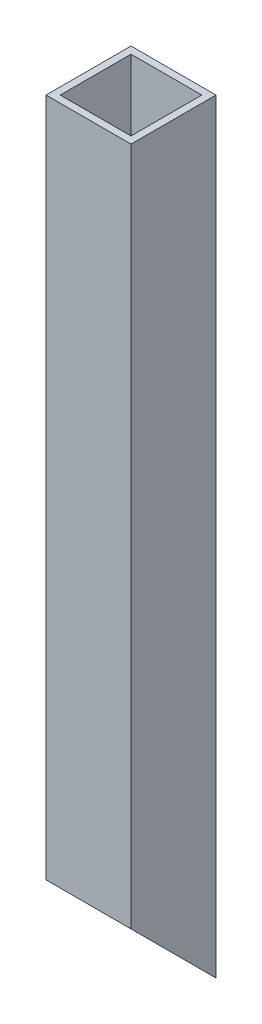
ISO-10303-21;
HEADER;
FILE_DESCRIPTION(('STEP AP214'),'2;1');
FILE_NAME('part.step','',(''),(''),'','','');
FILE_SCHEMA(('AUTOMOTIVE_DESIGN { 1 0 10303 214 1 1 1 1 }'));
ENDSEC;
DATA;
#1=APPLICATION_CONTEXT('core data for automotive mechanical design processes');
#2=APPLICATION_PROTOCOL_DEFINITION('international standard','automotive_design',2000,#1);
#3=PRODUCT_CONTEXT('',#1,'mechanical');
#4=PRODUCT('Part','Part','',(#3));
#5=PRODUCT_RELATED_PRODUCT_CATEGORY('part','',(#4));
#6=PRODUCT_DEFINITION_FORMATION('','',#4);
#7=PRODUCT_DEFINITION_CONTEXT('part definition',#1,'design');
#8=PRODUCT_DEFINITION('design','',#6,#7);
#9=PRODUCT_DEFINITION_SHAPE('','',#8);
#10=(LENGTH_UNIT() NAMED_UNIT(*) SI_UNIT(.MILLI.,.METRE.));
#11=(NAMED_UNIT(*) PLANE_ANGLE_UNIT() SI_UNIT($,.RADIAN.));
#12=(NAMED_UNIT(*) SI_UNIT($,.STERADIAN.) SOLID_ANGLE_UNIT());
#13=UNCERTAINTY_MEASURE_WITH_UNIT(LENGTH_MEASURE(1.E-05),#10,'distance_accuracy_value','');
#14=(GEOMETRIC_REPRESENTATION_CONTEXT(3) GLOBAL_UNCERTAINTY_ASSIGNED_CONTEXT((#13)) GLOBAL_UNIT_ASSIGNED_CONTEXT((#10,
#11,#12)) REPRESENTATION_CONTEXT('',''));
#15=CARTESIAN_POINT('',(0.,0.,0.));
#16=DIRECTION('',(0.,0.,1.));
#17=DIRECTION('',(1.,0.,0.));
#18=AXIS2_PLACEMENT_3D('',#15,#16,#17);
#19=CARTESIAN_POINT('',(-19.05,304.8,-19.05));
#20=DIRECTION('',(0.,0.,-1.));
#21=DIRECTION('',(-1.,0.,0.));
#22=AXIS2_PLACEMENT_3D('',#19,#20,#21);
#23=PLANE('',#22);
#24=DIRECTION('',(0.,-1.,0.));
#25=VECTOR('',#24,1.);
#26=CARTESIAN_POINT('',(19.05,304.8,-19.05));
#27=LINE('',#26,#25);
#28=CARTESIAN_POINT('',(19.05,304.8,-19.05));
#29=VERTEX_POINT('',#28);
#30=CARTESIAN_POINT('',(19.05,-38.1000000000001,-19.05));
#31=VERTEX_POINT('',#30);
#32=EDGE_CURVE('E150',#29,#31,#27,.T.);
#33=ORIENTED_EDGE('',*,*,#32,.T.);
#34=DIRECTION('',(1.,0.,0.));
#35=VECTOR('',#34,1.);
#36=CARTESIAN_POINT('',(-72.931536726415,-38.1000000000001,-19.05));
#37=LINE('',#36,#35);
#38=CARTESIAN_POINT('',(-19.05,-38.1000000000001,-19.05));
#39=VERTEX_POINT('',#38);
#40=EDGE_CURVE('E186',#39,#31,#37,.T.);
#41=ORIENTED_EDGE('',*,*,#40,.F.);
#42=DIRECTION('',(0.,-1.,0.));
#43=VECTOR('',#42,1.);
#44=CARTESIAN_POINT('',(-19.05,304.8,-19.05));
#45=LINE('',#44,#43);
#46=CARTESIAN_POINT('',(-19.05,304.8,-19.05));
#47=VERTEX_POINT('',#46);
#48=EDGE_CURVE('E141',#47,#39,#45,.T.);
#49=ORIENTED_EDGE('',*,*,#48,.F.);
#50=DIRECTION('',(1.,0.,0.));
#51=VECTOR('',#50,1.);
#52=CARTESIAN_POINT('',(-19.05,304.8,-19.05));
#53=LINE('',#52,#51);
#54=EDGE_CURVE('E163',#47,#29,#53,.T.);
#55=ORIENTED_EDGE('',*,*,#54,.T.);
#56=EDGE_LOOP('',(#33,#41,#49,#55));
#57=FACE_BOUND('',#56,.T.);
#58=ADVANCED_FACE('F64',(#57),#23,.T.);
#59=CARTESIAN_POINT('',(-19.05,304.8,-19.05));
#60=DIRECTION('',(1.,0.,0.));
#61=DIRECTION('',(0.,0.,-1.));
#62=AXIS2_PLACEMENT_3D('',#59,#60,#61);
#63=PLANE('',#62);
#64=ORIENTED_EDGE('',*,*,#48,.T.);
#65=DIRECTION('',(0.,0.707106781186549,0.707106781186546));
#66=VECTOR('',#65,1.);
#67=CARTESIAN_POINT('',(-19.05,-38.1000000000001,-19.05));
#68=LINE('',#67,#66);
#69=CARTESIAN_POINT('',(-19.05,0.,19.05));
#70=VERTEX_POINT('',#69);
#71=EDGE_CURVE('E183',#39,#70,#68,.T.);
#72=ORIENTED_EDGE('',*,*,#71,.T.);
#73=DIRECTION('',(0.,-1.,0.));
#74=VECTOR('',#73,1.);
#75=CARTESIAN_POINT('',(-19.05,304.8,19.05));
#76=LINE('',#75,#74);
#77=CARTESIAN_POINT('',(-19.05,304.8,19.05));
#78=VERTEX_POINT('',#77);
#79=EDGE_CURVE('E156',#78,#70,#76,.T.);
#80=ORIENTED_EDGE('',*,*,#79,.F.);
#81=DIRECTION('',(0.,0.,1.));
#82=VECTOR('',#81,1.);
#83=CARTESIAN_POINT('',(-19.05,304.8,-19.05));
#84=LINE('',#83,#82);
#85=EDGE_CURVE('E153',#47,#78,#84,.T.);
#86=ORIENTED_EDGE('',*,*,#85,.F.);
#87=EDGE_LOOP('',(#64,#72,#80,#86));
#88=FACE_BOUND('',#87,.T.);
#89=ADVANCED_FACE('F209',(#88),#63,.F.);
#90=CARTESIAN_POINT('',(-19.05,304.8,19.05));
#91=DIRECTION('',(0.,0.,-1.));
#92=DIRECTION('',(-1.,0.,0.));
#93=AXIS2_PLACEMENT_3D('',#90,#91,#92);
#94=PLANE('',#93);
#95=DIRECTION('',(1.,0.,0.));
#96=VECTOR('',#95,1.);
#97=CARTESIAN_POINT('',(-19.05,0.,19.05));
#98=LINE('',#97,#96);
#99=CARTESIAN_POINT('',(19.05,0.,19.05));
#100=VERTEX_POINT('',#99);
#101=EDGE_CURVE('E160',#70,#100,#98,.T.);
#102=ORIENTED_EDGE('',*,*,#101,.T.);
#103=DIRECTION('',(0.,-1.,0.));
#104=VECTOR('',#103,1.);
#105=CARTESIAN_POINT('',(19.05,304.8,19.05));
#106=LINE('',#105,#104);
#107=CARTESIAN_POINT('',(19.05,304.8,19.05));
#108=VERTEX_POINT('',#107);
#109=EDGE_CURVE('E152',#108,#100,#106,.T.);
#110=ORIENTED_EDGE('',*,*,#109,.F.);
#111=DIRECTION('',(1.,0.,0.));
#112=VECTOR('',#111,1.);
#113=CARTESIAN_POINT('',(-19.05,304.8,19.05));
#114=LINE('',#113,#112);
#115=EDGE_CURVE('E166',#78,#108,#114,.T.);
#116=ORIENTED_EDGE('',*,*,#115,.F.);
#117=ORIENTED_EDGE('',*,*,#79,.T.);
#118=EDGE_LOOP('',(#102,#110,#116,#117));
#119=FACE_BOUND('',#118,.T.);
#120=ADVANCED_FACE('F206',(#119),#94,.F.);
#121=CARTESIAN_POINT('',(19.05,304.8,-19.05));
#122=DIRECTION('',(1.,0.,0.));
#123=DIRECTION('',(0.,0.,-1.));
#124=AXIS2_PLACEMENT_3D('',#121,#122,#123);
#125=PLANE('',#124);
#126=ORIENTED_EDGE('',*,*,#109,.T.);
#127=DIRECTION('',(0.,-0.707106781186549,-0.707106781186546));
#128=VECTOR('',#127,1.);
#129=CARTESIAN_POINT('',(19.05,-38.1000000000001,-19.05));
#130=LINE('',#129,#128);
#131=EDGE_CURVE('E189',#100,#31,#130,.T.);
#132=ORIENTED_EDGE('',*,*,#131,.T.);
#133=ORIENTED_EDGE('',*,*,#32,.F.);
#134=DIRECTION('',(0.,0.,1.));
#135=VECTOR('',#134,1.);
#136=CARTESIAN_POINT('',(19.05,304.8,-19.05));
#137=LINE('',#136,#135);
#138=EDGE_CURVE('E168',#29,#108,#137,.T.);
#139=ORIENTED_EDGE('',*,*,#138,.T.);
#140=EDGE_LOOP('',(#126,#132,#133,#139));
#141=FACE_BOUND('',#140,.T.);
#142=ADVANCED_FACE('F192',(#141),#125,.T.);
#143=CARTESIAN_POINT('',(0.,304.8,0.));
#144=DIRECTION('',(0.,-1.,0.));
#145=DIRECTION('',(0.,0.,-1.));
#146=AXIS2_PLACEMENT_3D('',#143,#144,#145);
#147=PLANE('',#146);
#148=DIRECTION('',(0.,0.,1.));
#149=VECTOR('',#148,1.);
#150=CARTESIAN_POINT('',(-15.875,304.8,-15.875));
#151=LINE('',#150,#149);
#152=CARTESIAN_POINT('',(-15.875,304.8,-15.875));
#153=VERTEX_POINT('',#152);
#154=CARTESIAN_POINT('',(-15.875,304.8,15.875));
#155=VERTEX_POINT('',#154);
#156=EDGE_CURVE('E133',#153,#155,#151,.T.);
#157=ORIENTED_EDGE('',*,*,#156,.F.);
#158=DIRECTION('',(1.,0.,0.));
#159=VECTOR('',#158,1.);
#160=CARTESIAN_POINT('',(-15.875,304.8,-15.875));
#161=LINE('',#160,#159);
#162=CARTESIAN_POINT('',(15.875,304.8,-15.875));
#163=VERTEX_POINT('',#162);
#164=EDGE_CURVE('E181',#153,#163,#161,.T.);
#165=ORIENTED_EDGE('',*,*,#164,.T.);
#166=DIRECTION('',(0.,0.,1.));
#167=VECTOR('',#166,1.);
#168=CARTESIAN_POINT('',(15.875,304.8,-15.875));
#169=LINE('',#168,#167);
#170=CARTESIAN_POINT('',(15.875,304.8,15.875));
#171=VERTEX_POINT('',#170);
#172=EDGE_CURVE('E131',#163,#171,#169,.T.);
#173=ORIENTED_EDGE('',*,*,#172,.T.);
#174=DIRECTION('',(1.,0.,0.));
#175=VECTOR('',#174,1.);
#176=CARTESIAN_POINT('',(-15.875,304.8,15.875));
#177=LINE('',#176,#175);
#178=EDGE_CURVE('E178',#155,#171,#177,.T.);
#179=ORIENTED_EDGE('',*,*,#178,.F.);
#180=EDGE_LOOP('',(#157,#165,#173,#179));
#181=FACE_BOUND('',#180,.T.);
#182=ORIENTED_EDGE('',*,*,#54,.F.);
#183=ORIENTED_EDGE('',*,*,#85,.T.);
#184=ORIENTED_EDGE('',*,*,#115,.T.);
#185=ORIENTED_EDGE('',*,*,#138,.F.);
#186=EDGE_LOOP('',(#182,#183,#184,#185));
#187=FACE_BOUND('',#186,.T.);
#188=ADVANCED_FACE('F202',(#181,#187),#147,.F.);
#189=CARTESIAN_POINT('',(-15.875,304.8,-15.875));
#190=DIRECTION('',(0.,0.,-1.));
#191=DIRECTION('',(-1.,0.,0.));
#192=AXIS2_PLACEMENT_3D('',#189,#190,#191);
#193=PLANE('',#192);
#194=DIRECTION('',(0.,-1.,0.));
#195=VECTOR('',#194,1.);
#196=CARTESIAN_POINT('',(-15.875,304.8,-15.875));
#197=LINE('',#196,#195);
#198=CARTESIAN_POINT('',(-15.875,-34.9250000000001,-15.875));
#199=VERTEX_POINT('',#198);
#200=EDGE_CURVE('E78',#153,#199,#197,.T.);
#201=ORIENTED_EDGE('',*,*,#200,.T.);
#202=DIRECTION('',(1.,0.,0.));
#203=VECTOR('',#202,1.);
#204=CARTESIAN_POINT('',(-72.931536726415,-34.9250000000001,-15.875));
#205=LINE('',#204,#203);
#206=CARTESIAN_POINT('',(15.875,-34.9250000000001,-15.875));
#207=VERTEX_POINT('',#206);
#208=EDGE_CURVE('E136',#199,#207,#205,.T.);
#209=ORIENTED_EDGE('',*,*,#208,.T.);
#210=DIRECTION('',(0.,-1.,0.));
#211=VECTOR('',#210,1.);
#212=CARTESIAN_POINT('',(15.875,304.8,-15.875));
#213=LINE('',#212,#211);
#214=EDGE_CURVE('E126',#163,#207,#213,.T.);
#215=ORIENTED_EDGE('',*,*,#214,.F.);
#216=ORIENTED_EDGE('',*,*,#164,.F.);
#217=EDGE_LOOP('',(#201,#209,#215,#216));
#218=FACE_BOUND('',#217,.T.);
#219=ADVANCED_FACE('F137',(#218),#193,.F.);
#220=CARTESIAN_POINT('',(-15.875,304.8,-15.875));
#221=DIRECTION('',(1.,0.,0.));
#222=DIRECTION('',(0.,0.,-1.));
#223=AXIS2_PLACEMENT_3D('',#220,#221,#222);
#224=PLANE('',#223);
#225=DIRECTION('',(0.,-1.,0.));
#226=VECTOR('',#225,1.);
#227=CARTESIAN_POINT('',(-15.875,304.8,15.875));
#228=LINE('',#227,#226);
#229=CARTESIAN_POINT('',(-15.875,-3.17500000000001,15.875));
#230=VERTEX_POINT('',#229);
#231=EDGE_CURVE('E174',#155,#230,#228,.T.);
#232=ORIENTED_EDGE('',*,*,#231,.T.);
#233=DIRECTION('',(0.,-0.707106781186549,-0.707106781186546));
#234=VECTOR('',#233,1.);
#235=CARTESIAN_POINT('',(-15.875,-38.1000000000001,-19.05));
#236=LINE('',#235,#234);
#237=EDGE_CURVE('E140',#230,#199,#236,.T.);
#238=ORIENTED_EDGE('',*,*,#237,.T.);
#239=ORIENTED_EDGE('',*,*,#200,.F.);
#240=ORIENTED_EDGE('',*,*,#156,.T.);
#241=EDGE_LOOP('',(#232,#238,#239,#240));
#242=FACE_BOUND('',#241,.T.);
#243=ADVANCED_FACE('F227',(#242),#224,.T.);
#244=CARTESIAN_POINT('',(-15.875,304.8,15.875));
#245=DIRECTION('',(0.,0.,-1.));
#246=DIRECTION('',(-1.,0.,0.));
#247=AXIS2_PLACEMENT_3D('',#244,#245,#246);
#248=PLANE('',#247);
#249=DIRECTION('',(0.,-1.,0.));
#250=VECTOR('',#249,1.);
#251=CARTESIAN_POINT('',(15.875,304.8,15.875));
#252=LINE('',#251,#250);
#253=CARTESIAN_POINT('',(15.875,-3.17500000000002,15.875));
#254=VERTEX_POINT('',#253);
#255=EDGE_CURVE('E85',#171,#254,#252,.T.);
#256=ORIENTED_EDGE('',*,*,#255,.T.);
#257=DIRECTION('',(-1.,0.,0.));
#258=VECTOR('',#257,1.);
#259=CARTESIAN_POINT('',(-72.931536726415,-3.17500000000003,15.875));
#260=LINE('',#259,#258);
#261=EDGE_CURVE('E71',#254,#230,#260,.T.);
#262=ORIENTED_EDGE('',*,*,#261,.T.);
#263=ORIENTED_EDGE('',*,*,#231,.F.);
#264=ORIENTED_EDGE('',*,*,#178,.T.);
#265=EDGE_LOOP('',(#256,#262,#263,#264));
#266=FACE_BOUND('',#265,.T.);
#267=ADVANCED_FACE('F231',(#266),#248,.T.);
#268=CARTESIAN_POINT('',(15.875,304.8,-15.875));
#269=DIRECTION('',(1.,0.,0.));
#270=DIRECTION('',(0.,0.,-1.));
#271=AXIS2_PLACEMENT_3D('',#268,#269,#270);
#272=PLANE('',#271);
#273=ORIENTED_EDGE('',*,*,#214,.T.);
#274=DIRECTION('',(0.,0.707106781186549,0.707106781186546));
#275=VECTOR('',#274,1.);
#276=CARTESIAN_POINT('',(15.875,-38.1000000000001,-19.05));
#277=LINE('',#276,#275);
#278=EDGE_CURVE('E12',#207,#254,#277,.T.);
#279=ORIENTED_EDGE('',*,*,#278,.T.);
#280=ORIENTED_EDGE('',*,*,#255,.F.);
#281=ORIENTED_EDGE('',*,*,#172,.F.);
#282=EDGE_LOOP('',(#273,#279,#280,#281));
#283=FACE_BOUND('',#282,.T.);
#284=ADVANCED_FACE('F127',(#283),#272,.F.);
#285=CARTESIAN_POINT('',(-72.931536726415,-38.1000000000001,-19.05));
#286=DIRECTION('',(0.,-0.707106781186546,0.707106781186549));
#287=DIRECTION('',(0.,-0.707106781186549,-0.707106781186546));
#288=AXIS2_PLACEMENT_3D('',#285,#286,#287);
#289=PLANE('',#288);
#290=ORIENTED_EDGE('',*,*,#278,.F.);
#291=ORIENTED_EDGE('',*,*,#208,.F.);
#292=ORIENTED_EDGE('',*,*,#237,.F.);
#293=ORIENTED_EDGE('',*,*,#261,.F.);
#294=EDGE_LOOP('',(#290,#291,#292,#293));
#295=FACE_BOUND('',#294,.T.);
#296=ORIENTED_EDGE('',*,*,#71,.F.);
#297=ORIENTED_EDGE('',*,*,#40,.T.);
#298=ORIENTED_EDGE('',*,*,#131,.F.);
#299=ORIENTED_EDGE('',*,*,#101,.F.);
#300=EDGE_LOOP('',(#296,#297,#298,#299));
#301=FACE_BOUND('',#300,.T.);
#302=ADVANCED_FACE('F143',(#295,#301),#289,.T.);
#303=CLOSED_SHELL('',(#58,#89,#120,#142,#188,#219,#243,#267,#284,#302));
#304=MANIFOLD_SOLID_BREP('B2',#303);
#305=ADVANCED_BREP_SHAPE_REPRESENTATION('',(#18,#304),#14);
#306=SHAPE_DEFINITION_REPRESENTATION(#9,#305);
ENDSEC;
END-ISO-10303-21;
